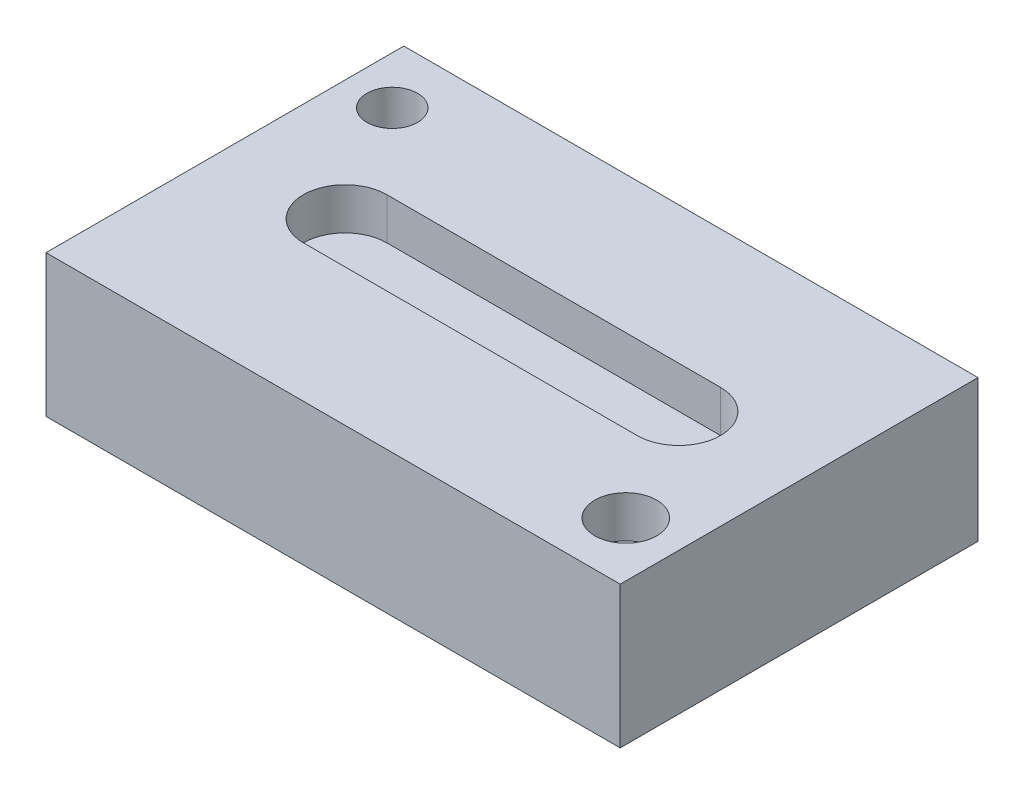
from build123d import *

# Parameters (mm, degrees)
SKETCH1_W           = 174.796166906
SKETCH1_H           = 108.92723011
BOSS_EXTRUDE1_DEPTH = 43.18
SKETCH2_R           = 7.697413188
SKETCH2_R_2         = 9.430807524
CUT_EXTRUDE1_DEPTH  = 12.7


with BuildPart() as part:
    # Sketch1 → Boss-Extrude1 (new body)
    with BuildSketch(Plane(origin=(0, 0, 0), x_dir=(1, 0, 0), z_dir=(0, 1, 0))):
        Rectangle(SKETCH1_W, SKETCH1_H)
    extrude(amount=BOSS_EXTRUDE1_DEPTH)

    # Sketch2 → Cut-Extrude1 (cut)
    with BuildSketch(Plane(origin=(0, 43.18, 0), x_dir=(1, 0, 0), z_dir=(0, 1, 0))):
        with Locations(Location((-72.874036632, 36.40863105, 0), (0, 0, 270))):
            Circle(SKETCH2_R)
        with Locations(Location((70.801263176, -36.157833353, 0), (0, 0, 270))):
            Circle(SKETCH2_R_2)
        with BuildLine():
            Line((-50.8, 12.7), (50.8, 12.7))
            ThreePointArc((50.8, 12.7), (63.5, 0), (50.8, -12.7))
            Line((50.8, -12.7), (-50.8, -12.7))
            ThreePointArc((-50.8, -12.7), (-63.5, 0), (-50.8, 12.7))
        make_face()
    extrude(amount=-CUT_EXTRUDE1_DEPTH, mode=Mode.SUBTRACT)


solid = part.part
